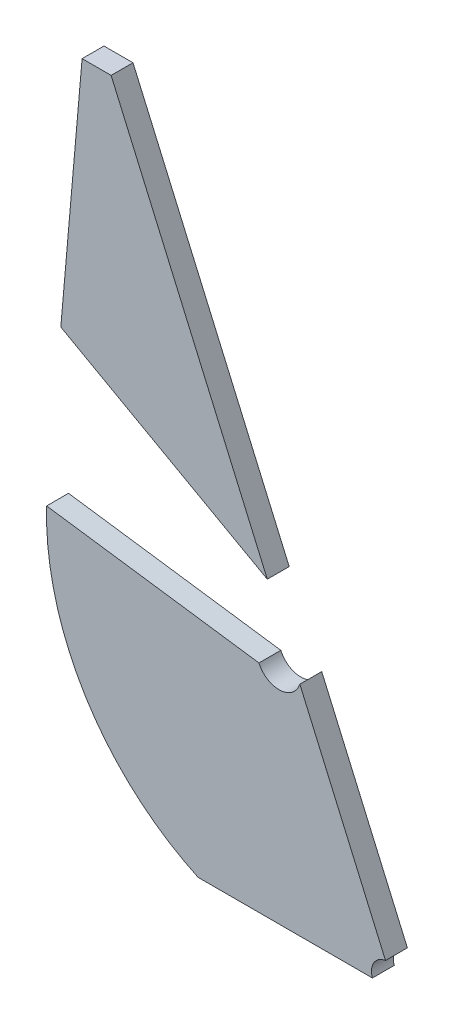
ISO-10303-21;
HEADER;
FILE_DESCRIPTION(('STEP AP214'),'2;1');
FILE_NAME('part.step','',(''),(''),'','','');
FILE_SCHEMA(('AUTOMOTIVE_DESIGN { 1 0 10303 214 1 1 1 1 }'));
ENDSEC;
DATA;
#1=APPLICATION_CONTEXT('core data for automotive mechanical design processes');
#2=APPLICATION_PROTOCOL_DEFINITION('international standard','automotive_design',2000,#1);
#3=PRODUCT_CONTEXT('',#1,'mechanical');
#4=PRODUCT('Part','Part','',(#3));
#5=PRODUCT_RELATED_PRODUCT_CATEGORY('part','',(#4));
#6=PRODUCT_DEFINITION_FORMATION('','',#4);
#7=PRODUCT_DEFINITION_CONTEXT('part definition',#1,'design');
#8=PRODUCT_DEFINITION('design','',#6,#7);
#9=PRODUCT_DEFINITION_SHAPE('','',#8);
#10=(LENGTH_UNIT() NAMED_UNIT(*) SI_UNIT(.MILLI.,.METRE.));
#11=(NAMED_UNIT(*) PLANE_ANGLE_UNIT() SI_UNIT($,.RADIAN.));
#12=(NAMED_UNIT(*) SI_UNIT($,.STERADIAN.) SOLID_ANGLE_UNIT());
#13=UNCERTAINTY_MEASURE_WITH_UNIT(LENGTH_MEASURE(1.E-05),#10,'distance_accuracy_value','');
#14=(GEOMETRIC_REPRESENTATION_CONTEXT(3) GLOBAL_UNCERTAINTY_ASSIGNED_CONTEXT((#13)) GLOBAL_UNIT_ASSIGNED_CONTEXT((#10,
#11,#12)) REPRESENTATION_CONTEXT('',''));
#15=CARTESIAN_POINT('',(0.,0.,0.));
#16=DIRECTION('',(0.,0.,1.));
#17=DIRECTION('',(1.,0.,0.));
#18=AXIS2_PLACEMENT_3D('',#15,#16,#17);
#19=CARTESIAN_POINT('',(230.346732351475,-304.807768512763,25.4));
#20=DIRECTION('',(0.,0.,1.));
#21=DIRECTION('',(1.,0.,0.));
#22=AXIS2_PLACEMENT_3D('',#19,#20,#21);
#23=PLANE('',#22);
#24=DIRECTION('',(-0.873457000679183,0.486901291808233,0.));
#25=VECTOR('',#24,1.);
#26=CARTESIAN_POINT('',(-22.9270015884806,-92.3570586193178,25.4));
#27=LINE('',#26,#25);
#28=CARTESIAN_POINT('',(216.75454114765,-225.965527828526,25.4));
#29=VERTEX_POINT('',#28);
#30=CARTESIAN_POINT('',(-22.9270015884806,-92.3570586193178,25.4));
#31=VERTEX_POINT('',#30);
#32=EDGE_CURVE('E58',#29,#31,#27,.T.);
#33=ORIENTED_EDGE('',*,*,#32,.F.);
#34=DIRECTION('',(-0.399652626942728,0.916666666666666,0.));
#35=VECTOR('',#34,1.);
#36=CARTESIAN_POINT('',(35.4644551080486,189.852028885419,25.4));
#37=LINE('',#36,#35);
#38=CARTESIAN_POINT('',(35.4644551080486,189.852028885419,25.4));
#39=VERTEX_POINT('',#38);
#40=EDGE_CURVE('E115',#29,#39,#37,.T.);
#41=ORIENTED_EDGE('',*,*,#40,.T.);
#42=DIRECTION('',(-1.,0.,0.));
#43=VECTOR('',#42,1.);
#44=CARTESIAN_POINT('',(1.78458492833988,189.852028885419,25.4));
#45=LINE('',#44,#43);
#46=CARTESIAN_POINT('',(1.78458492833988,189.852028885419,25.4));
#47=VERTEX_POINT('',#46);
#48=EDGE_CURVE('E113',#39,#47,#45,.T.);
#49=ORIENTED_EDGE('',*,*,#48,.T.);
#50=DIRECTION('',(-0.0872310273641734,-0.996188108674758,0.));
#51=VECTOR('',#50,1.);
#52=CARTESIAN_POINT('',(1.78458492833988,189.852028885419,25.4));
#53=LINE('',#52,#51);
#54=EDGE_CURVE('E98',#47,#31,#53,.T.);
#55=ORIENTED_EDGE('',*,*,#54,.T.);
#56=EDGE_LOOP('',(#33,#41,#49,#55));
#57=FACE_BOUND('',#56,.T.);
#58=ADVANCED_FACE('F48',(#57),#23,.T.);
#59=CARTESIAN_POINT('',(230.346732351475,-304.807768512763,0.));
#60=DIRECTION('',(0.,0.,1.));
#61=DIRECTION('',(1.,0.,0.));
#62=AXIS2_PLACEMENT_3D('',#59,#60,#61);
#63=PLANE('',#62);
#64=DIRECTION('',(-0.399652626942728,0.916666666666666,0.));
#65=VECTOR('',#64,1.);
#66=CARTESIAN_POINT('',(35.4644551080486,189.852028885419,0.));
#67=LINE('',#66,#65);
#68=CARTESIAN_POINT('',(216.75454114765,-225.965527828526,0.));
#69=VERTEX_POINT('',#68);
#70=CARTESIAN_POINT('',(35.4644551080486,189.852028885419,0.));
#71=VERTEX_POINT('',#70);
#72=EDGE_CURVE('E97',#69,#71,#67,.T.);
#73=ORIENTED_EDGE('',*,*,#72,.F.);
#74=DIRECTION('',(-0.873457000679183,0.486901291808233,0.));
#75=VECTOR('',#74,1.);
#76=CARTESIAN_POINT('',(-22.9270015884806,-92.3570586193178,0.));
#77=LINE('',#76,#75);
#78=CARTESIAN_POINT('',(-22.9270015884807,-92.3570586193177,0.));
#79=VERTEX_POINT('',#78);
#80=EDGE_CURVE('E52',#69,#79,#77,.T.);
#81=ORIENTED_EDGE('',*,*,#80,.T.);
#82=DIRECTION('',(-0.0872310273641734,-0.996188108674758,0.));
#83=VECTOR('',#82,1.);
#84=CARTESIAN_POINT('',(1.78458492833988,189.852028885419,0.));
#85=LINE('',#84,#83);
#86=CARTESIAN_POINT('',(1.78458492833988,189.852028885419,0.));
#87=VERTEX_POINT('',#86);
#88=EDGE_CURVE('E91',#87,#79,#85,.T.);
#89=ORIENTED_EDGE('',*,*,#88,.F.);
#90=DIRECTION('',(-1.,0.,0.));
#91=VECTOR('',#90,1.);
#92=CARTESIAN_POINT('',(1.78458492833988,189.852028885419,0.));
#93=LINE('',#92,#91);
#94=EDGE_CURVE('E105',#71,#87,#93,.T.);
#95=ORIENTED_EDGE('',*,*,#94,.F.);
#96=EDGE_LOOP('',(#73,#81,#89,#95));
#97=FACE_BOUND('',#96,.T.);
#98=ADVANCED_FACE('F50',(#97),#63,.F.);
#99=CARTESIAN_POINT('',(35.4644551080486,189.852028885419,25.4));
#100=DIRECTION('',(-0.916666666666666,-0.399652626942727,0.));
#101=DIRECTION('',(0.399652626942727,-0.916666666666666,0.));
#102=AXIS2_PLACEMENT_3D('',#99,#100,#101);
#103=PLANE('',#102);
#104=ORIENTED_EDGE('',*,*,#40,.F.);
#105=DIRECTION('',(0.,0.,1.));
#106=VECTOR('',#105,1.);
#107=CARTESIAN_POINT('',(216.75454114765,-225.965527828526,0.));
#108=LINE('',#107,#106);
#109=EDGE_CURVE('E12',#69,#29,#108,.T.);
#110=ORIENTED_EDGE('',*,*,#109,.F.);
#111=ORIENTED_EDGE('',*,*,#72,.T.);
#112=DIRECTION('',(0.,0.,-1.));
#113=VECTOR('',#112,1.);
#114=CARTESIAN_POINT('',(35.4644551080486,189.852028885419,25.4));
#115=LINE('',#114,#113);
#116=EDGE_CURVE('E102',#39,#71,#115,.T.);
#117=ORIENTED_EDGE('',*,*,#116,.F.);
#118=EDGE_LOOP('',(#104,#110,#111,#117));
#119=FACE_BOUND('',#118,.T.);
#120=ADVANCED_FACE('F122',(#119),#103,.F.);
#121=CARTESIAN_POINT('',(1.78458492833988,189.852028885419,25.4));
#122=DIRECTION('',(0.,-1.,0.));
#123=DIRECTION('',(0.,0.,-1.));
#124=AXIS2_PLACEMENT_3D('',#121,#122,#123);
#125=PLANE('',#124);
#126=ORIENTED_EDGE('',*,*,#94,.T.);
#127=DIRECTION('',(0.,0.,-1.));
#128=VECTOR('',#127,1.);
#129=CARTESIAN_POINT('',(1.78458492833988,189.852028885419,25.4));
#130=LINE('',#129,#128);
#131=EDGE_CURVE('E90',#47,#87,#130,.T.);
#132=ORIENTED_EDGE('',*,*,#131,.F.);
#133=ORIENTED_EDGE('',*,*,#48,.F.);
#134=ORIENTED_EDGE('',*,*,#116,.T.);
#135=EDGE_LOOP('',(#126,#132,#133,#134));
#136=FACE_BOUND('',#135,.T.);
#137=ADVANCED_FACE('F124',(#136),#125,.F.);
#138=CARTESIAN_POINT('',(1.78458492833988,189.852028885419,25.4));
#139=DIRECTION('',(0.996188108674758,-0.0872310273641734,0.));
#140=DIRECTION('',(0.0872310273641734,0.996188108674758,0.));
#141=AXIS2_PLACEMENT_3D('',#138,#139,#140);
#142=PLANE('',#141);
#143=ORIENTED_EDGE('',*,*,#88,.T.);
#144=DIRECTION('',(0.,0.,1.));
#145=VECTOR('',#144,1.);
#146=CARTESIAN_POINT('',(-22.9270015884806,-92.3570586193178,0.));
#147=LINE('',#146,#145);
#148=EDGE_CURVE('E83',#79,#31,#147,.T.);
#149=ORIENTED_EDGE('',*,*,#148,.T.);
#150=ORIENTED_EDGE('',*,*,#54,.F.);
#151=ORIENTED_EDGE('',*,*,#131,.T.);
#152=EDGE_LOOP('',(#143,#149,#150,#151));
#153=FACE_BOUND('',#152,.T.);
#154=ADVANCED_FACE('F100',(#153),#142,.F.);
#155=CARTESIAN_POINT('',(-22.9270015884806,-92.3570586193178,0.));
#156=DIRECTION('',(0.486901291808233,0.873457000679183,0.));
#157=DIRECTION('',(-0.873457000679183,0.486901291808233,0.));
#158=AXIS2_PLACEMENT_3D('',#155,#156,#157);
#159=PLANE('',#158);
#160=ORIENTED_EDGE('',*,*,#32,.T.);
#161=ORIENTED_EDGE('',*,*,#148,.F.);
#162=ORIENTED_EDGE('',*,*,#80,.F.);
#163=ORIENTED_EDGE('',*,*,#109,.T.);
#164=EDGE_LOOP('',(#160,#161,#162,#163));
#165=FACE_BOUND('',#164,.T.);
#166=ADVANCED_FACE('F85',(#165),#159,.F.);
#167=CLOSED_SHELL('',(#58,#98,#120,#137,#154,#166));
#168=MANIFOLD_SOLID_BREP('B2',#167);
#169=CARTESIAN_POINT('',(338.751220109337,-565.806003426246,25.4));
#170=DIRECTION('',(0.,1.,0.));
#171=DIRECTION('',(0.,0.,1.));
#172=AXIS2_PLACEMENT_3D('',#169,#170,#171);
#173=PLANE('',#172);
#174=DIRECTION('',(1.,0.,0.));
#175=VECTOR('',#174,1.);
#176=CARTESIAN_POINT('',(338.751220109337,-565.806003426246,0.));
#177=LINE('',#176,#175);
#178=CARTESIAN_POINT('',(136.419920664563,-565.806003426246,0.));
#179=VERTEX_POINT('',#178);
#180=CARTESIAN_POINT('',(338.751220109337,-565.806003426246,0.));
#181=VERTEX_POINT('',#180);
#182=EDGE_CURVE('E265',#179,#181,#177,.T.);
#183=ORIENTED_EDGE('',*,*,#182,.T.);
#184=DIRECTION('',(0.,0.,-1.));
#185=VECTOR('',#184,1.);
#186=CARTESIAN_POINT('',(338.751220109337,-565.806003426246,25.4));
#187=LINE('',#186,#185);
#188=CARTESIAN_POINT('',(338.751220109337,-565.806003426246,25.4));
#189=VERTEX_POINT('',#188);
#190=EDGE_CURVE('E288',#189,#181,#187,.T.);
#191=ORIENTED_EDGE('',*,*,#190,.F.);
#192=DIRECTION('',(1.,0.,0.));
#193=VECTOR('',#192,1.);
#194=CARTESIAN_POINT('',(338.751220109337,-565.806003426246,25.4));
#195=LINE('',#194,#193);
#196=CARTESIAN_POINT('',(136.419920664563,-565.806003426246,25.4));
#197=VERTEX_POINT('',#196);
#198=EDGE_CURVE('E295',#197,#189,#195,.T.);
#199=ORIENTED_EDGE('',*,*,#198,.F.);
#200=DIRECTION('',(0.,0.,-1.));
#201=VECTOR('',#200,1.);
#202=CARTESIAN_POINT('',(136.419920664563,-565.806003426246,25.4));
#203=LINE('',#202,#201);
#204=EDGE_CURVE('E187',#197,#179,#203,.T.);
#205=ORIENTED_EDGE('',*,*,#204,.T.);
#206=EDGE_LOOP('',(#183,#191,#199,#205));
#207=FACE_BOUND('',#206,.T.);
#208=ADVANCED_FACE('F179',(#207),#173,.F.);
#209=CARTESIAN_POINT('',(356.711732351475,-559.456003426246,25.4));
#210=DIRECTION('',(0.,0.,-1.));
#211=DIRECTION('',(-1.,0.,0.));
#212=AXIS2_PLACEMENT_3D('',#209,#210,#211);
#213=CYLINDRICAL_SURFACE('',#212,19.05);
#214=CARTESIAN_POINT('',(356.711732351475,-559.456003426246,0.));
#215=DIRECTION('',(0.,0.,-1.));
#216=DIRECTION('',(1.,0.,0.));
#217=AXIS2_PLACEMENT_3D('',#214,#215,#216);
#218=CIRCLE('',#217,19.05);
#219=CARTESIAN_POINT('',(353.934507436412,-540.6095310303,0.));
#220=VERTEX_POINT('',#219);
#221=EDGE_CURVE('E271',#181,#220,#218,.T.);
#222=ORIENTED_EDGE('',*,*,#221,.T.);
#223=DIRECTION('',(0.,0.,-1.));
#224=VECTOR('',#223,1.);
#225=CARTESIAN_POINT('',(353.934507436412,-540.6095310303,25.4));
#226=LINE('',#225,#224);
#227=CARTESIAN_POINT('',(353.934507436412,-540.6095310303,25.4));
#228=VERTEX_POINT('',#227);
#229=EDGE_CURVE('E285',#228,#220,#226,.T.);
#230=ORIENTED_EDGE('',*,*,#229,.F.);
#231=CARTESIAN_POINT('',(356.711732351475,-559.456003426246,25.4));
#232=DIRECTION('',(0.,0.,-1.));
#233=DIRECTION('',(1.,0.,0.));
#234=AXIS2_PLACEMENT_3D('',#231,#232,#233);
#235=CIRCLE('',#234,19.05);
#236=EDGE_CURVE('E298',#189,#228,#235,.T.);
#237=ORIENTED_EDGE('',*,*,#236,.F.);
#238=ORIENTED_EDGE('',*,*,#190,.T.);
#239=EDGE_LOOP('',(#222,#230,#237,#238));
#240=FACE_BOUND('',#239,.T.);
#241=ADVANCED_FACE('F321',(#240),#213,.F.);
#242=CARTESIAN_POINT('',(254.523604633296,-312.594863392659,25.4));
#243=DIRECTION('',(-0.916666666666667,-0.399652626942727,0.));
#244=DIRECTION('',(0.399652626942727,-0.916666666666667,0.));
#245=AXIS2_PLACEMENT_3D('',#242,#243,#244);
#246=PLANE('',#245);
#247=DIRECTION('',(-0.399652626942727,0.916666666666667,0.));
#248=VECTOR('',#247,1.);
#249=CARTESIAN_POINT('',(254.523604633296,-312.594863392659,0.));
#250=LINE('',#249,#248);
#251=CARTESIAN_POINT('',(254.523604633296,-312.594863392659,0.));
#252=VERTEX_POINT('',#251);
#253=EDGE_CURVE('E233',#220,#252,#250,.T.);
#254=ORIENTED_EDGE('',*,*,#253,.T.);
#255=DIRECTION('',(0.,0.,-1.));
#256=VECTOR('',#255,1.);
#257=CARTESIAN_POINT('',(254.523604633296,-312.594863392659,25.4));
#258=LINE('',#257,#256);
#259=CARTESIAN_POINT('',(254.523604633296,-312.594863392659,25.4));
#260=VERTEX_POINT('',#259);
#261=EDGE_CURVE('E282',#260,#252,#258,.T.);
#262=ORIENTED_EDGE('',*,*,#261,.F.);
#263=DIRECTION('',(-0.399652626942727,0.916666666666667,0.));
#264=VECTOR('',#263,1.);
#265=CARTESIAN_POINT('',(254.523604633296,-312.594863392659,25.4));
#266=LINE('',#265,#264);
#267=EDGE_CURVE('E208',#228,#260,#266,.T.);
#268=ORIENTED_EDGE('',*,*,#267,.F.);
#269=ORIENTED_EDGE('',*,*,#229,.T.);
#270=EDGE_LOOP('',(#254,#262,#268,#269));
#271=FACE_BOUND('',#270,.T.);
#272=ADVANCED_FACE('F314',(#271),#246,.F.);
#273=CARTESIAN_POINT('',(230.346732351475,-304.807768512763,25.4));
#274=DIRECTION('',(0.,0.,1.));
#275=DIRECTION('',(1.,0.,0.));
#276=AXIS2_PLACEMENT_3D('',#273,#274,#275);
#277=PLANE('',#276);
#278=DIRECTION('',(0.990282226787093,-0.139072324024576,0.));
#279=VECTOR('',#278,1.);
#280=CARTESIAN_POINT('',(-39.3883918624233,-280.347980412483,25.4));
#281=LINE('',#280,#279);
#282=CARTESIAN_POINT('',(-39.3883918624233,-280.347980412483,25.4));
#283=VERTEX_POINT('',#282);
#284=CARTESIAN_POINT('',(207.063399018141,-314.958945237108,25.4));
#285=VERTEX_POINT('',#284);
#286=EDGE_CURVE('E256',#283,#285,#281,.T.);
#287=ORIENTED_EDGE('',*,*,#286,.F.);
#288=CARTESIAN_POINT('',(265.271732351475,-289.581003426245,25.4));
#289=DIRECTION('',(0.,0.,1.));
#290=DIRECTION('',(1.,0.,0.));
#291=AXIS2_PLACEMENT_3D('',#288,#289,#290);
#292=CIRCLE('',#291,304.8);
#293=EDGE_CURVE('E240',#283,#197,#292,.T.);
#294=ORIENTED_EDGE('',*,*,#293,.T.);
#295=ORIENTED_EDGE('',*,*,#198,.T.);
#296=ORIENTED_EDGE('',*,*,#236,.T.);
#297=ORIENTED_EDGE('',*,*,#267,.T.);
#298=CARTESIAN_POINT('',(230.346732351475,-304.807768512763,25.4));
#299=DIRECTION('',(0.,0.,-1.));
#300=DIRECTION('',(1.,0.,0.));
#301=AXIS2_PLACEMENT_3D('',#298,#299,#300);
#302=CIRCLE('',#301,25.4);
#303=EDGE_CURVE('E281',#260,#285,#302,.T.);
#304=ORIENTED_EDGE('',*,*,#303,.T.);
#305=EDGE_LOOP('',(#287,#294,#295,#296,#297,#304));
#306=FACE_BOUND('',#305,.T.);
#307=ADVANCED_FACE('F312',(#306),#277,.T.);
#308=CARTESIAN_POINT('',(230.346732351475,-304.807768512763,0.));
#309=DIRECTION('',(0.,0.,1.));
#310=DIRECTION('',(1.,0.,0.));
#311=AXIS2_PLACEMENT_3D('',#308,#309,#310);
#312=PLANE('',#311);
#313=CARTESIAN_POINT('',(265.271732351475,-289.581003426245,0.));
#314=DIRECTION('',(0.,0.,1.));
#315=DIRECTION('',(1.,0.,0.));
#316=AXIS2_PLACEMENT_3D('',#313,#314,#315);
#317=CIRCLE('',#316,304.8);
#318=CARTESIAN_POINT('',(-39.3883918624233,-280.347980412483,0.));
#319=VERTEX_POINT('',#318);
#320=EDGE_CURVE('E260',#319,#179,#317,.T.);
#321=ORIENTED_EDGE('',*,*,#320,.F.);
#322=DIRECTION('',(0.990282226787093,-0.139072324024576,0.));
#323=VECTOR('',#322,1.);
#324=CARTESIAN_POINT('',(-39.3883918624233,-280.347980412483,0.));
#325=LINE('',#324,#323);
#326=CARTESIAN_POINT('',(207.063399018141,-314.958945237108,0.));
#327=VERTEX_POINT('',#326);
#328=EDGE_CURVE('E249',#319,#327,#325,.T.);
#329=ORIENTED_EDGE('',*,*,#328,.T.);
#330=CARTESIAN_POINT('',(230.346732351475,-304.807768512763,0.));
#331=DIRECTION('',(0.,0.,-1.));
#332=DIRECTION('',(1.,0.,0.));
#333=AXIS2_PLACEMENT_3D('',#330,#331,#332);
#334=CIRCLE('',#333,25.4);
#335=EDGE_CURVE('E267',#252,#327,#334,.T.);
#336=ORIENTED_EDGE('',*,*,#335,.F.);
#337=ORIENTED_EDGE('',*,*,#253,.F.);
#338=ORIENTED_EDGE('',*,*,#221,.F.);
#339=ORIENTED_EDGE('',*,*,#182,.F.);
#340=EDGE_LOOP('',(#321,#329,#336,#337,#338,#339));
#341=FACE_BOUND('',#340,.T.);
#342=ADVANCED_FACE('F263',(#341),#312,.F.);
#343=CARTESIAN_POINT('',(265.271732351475,-289.581003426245,25.4));
#344=DIRECTION('',(0.,0.,-1.));
#345=DIRECTION('',(-1.,0.,0.));
#346=AXIS2_PLACEMENT_3D('',#343,#344,#345);
#347=CYLINDRICAL_SURFACE('',#346,304.8);
#348=ORIENTED_EDGE('',*,*,#320,.T.);
#349=ORIENTED_EDGE('',*,*,#204,.F.);
#350=ORIENTED_EDGE('',*,*,#293,.F.);
#351=DIRECTION('',(0.,0.,-1.));
#352=VECTOR('',#351,1.);
#353=CARTESIAN_POINT('',(-39.3883918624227,-280.347980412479,25.4));
#354=LINE('',#353,#352);
#355=EDGE_CURVE('E46',#283,#319,#354,.T.);
#356=ORIENTED_EDGE('',*,*,#355,.T.);
#357=EDGE_LOOP('',(#348,#349,#350,#356));
#358=FACE_BOUND('',#357,.T.);
#359=ADVANCED_FACE('F259',(#358),#347,.T.);
#360=CARTESIAN_POINT('',(230.346732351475,-304.807768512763,25.4));
#361=DIRECTION('',(0.,0.,-1.));
#362=DIRECTION('',(-1.,0.,0.));
#363=AXIS2_PLACEMENT_3D('',#360,#361,#362);
#364=CYLINDRICAL_SURFACE('',#363,25.4);
#365=ORIENTED_EDGE('',*,*,#335,.T.);
#366=DIRECTION('',(0.,0.,1.));
#367=VECTOR('',#366,1.);
#368=CARTESIAN_POINT('',(207.063399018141,-314.958945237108,0.));
#369=LINE('',#368,#367);
#370=EDGE_CURVE('E196',#327,#285,#369,.T.);
#371=ORIENTED_EDGE('',*,*,#370,.T.);
#372=ORIENTED_EDGE('',*,*,#303,.F.);
#373=ORIENTED_EDGE('',*,*,#261,.T.);
#374=EDGE_LOOP('',(#365,#371,#372,#373));
#375=FACE_BOUND('',#374,.T.);
#376=ADVANCED_FACE('F181',(#375),#364,.F.);
#377=CARTESIAN_POINT('',(-39.3883918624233,-280.347980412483,0.));
#378=DIRECTION('',(-0.139072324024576,-0.990282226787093,0.));
#379=DIRECTION('',(0.990282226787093,-0.139072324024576,0.));
#380=AXIS2_PLACEMENT_3D('',#377,#378,#379);
#381=PLANE('',#380);
#382=ORIENTED_EDGE('',*,*,#286,.T.);
#383=ORIENTED_EDGE('',*,*,#370,.F.);
#384=ORIENTED_EDGE('',*,*,#328,.F.);
#385=ORIENTED_EDGE('',*,*,#355,.F.);
#386=EDGE_LOOP('',(#382,#383,#384,#385));
#387=FACE_BOUND('',#386,.T.);
#388=ADVANCED_FACE('F250',(#387),#381,.F.);
#389=CLOSED_SHELL('',(#208,#241,#272,#307,#342,#359,#376,#388));
#390=MANIFOLD_SOLID_BREP('B6',#389);
#391=ADVANCED_BREP_SHAPE_REPRESENTATION('',(#18,#168,#390),#14);
#392=SHAPE_DEFINITION_REPRESENTATION(#9,#391);
ENDSEC;
END-ISO-10303-21;
